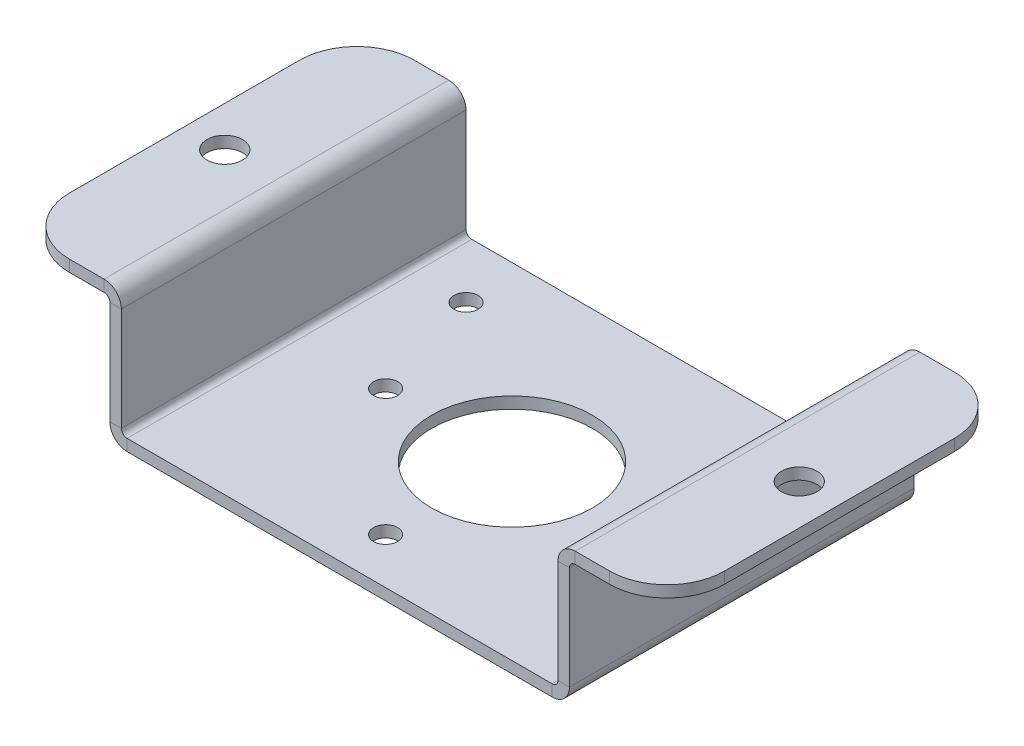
ISO-10303-21;
HEADER;
FILE_DESCRIPTION(('STEP AP214'),'2;1');
FILE_NAME('part.step','',(''),(''),'','','');
FILE_SCHEMA(('AUTOMOTIVE_DESIGN { 1 0 10303 214 1 1 1 1 }'));
ENDSEC;
DATA;
#1=APPLICATION_CONTEXT('core data for automotive mechanical design processes');
#2=APPLICATION_PROTOCOL_DEFINITION('international standard','automotive_design',2000,#1);
#3=PRODUCT_CONTEXT('',#1,'mechanical');
#4=PRODUCT('Part','Part','',(#3));
#5=PRODUCT_RELATED_PRODUCT_CATEGORY('part','',(#4));
#6=PRODUCT_DEFINITION_FORMATION('','',#4);
#7=PRODUCT_DEFINITION_CONTEXT('part definition',#1,'design');
#8=PRODUCT_DEFINITION('design','',#6,#7);
#9=PRODUCT_DEFINITION_SHAPE('','',#8);
#10=(LENGTH_UNIT() NAMED_UNIT(*) SI_UNIT(.MILLI.,.METRE.));
#11=(NAMED_UNIT(*) PLANE_ANGLE_UNIT() SI_UNIT($,.RADIAN.));
#12=(NAMED_UNIT(*) SI_UNIT($,.STERADIAN.) SOLID_ANGLE_UNIT());
#13=UNCERTAINTY_MEASURE_WITH_UNIT(LENGTH_MEASURE(1.E-05),#10,'distance_accuracy_value','');
#14=(GEOMETRIC_REPRESENTATION_CONTEXT(3) GLOBAL_UNCERTAINTY_ASSIGNED_CONTEXT((#13)) GLOBAL_UNIT_ASSIGNED_CONTEXT((#10,
#11,#12)) REPRESENTATION_CONTEXT('',''));
#15=CARTESIAN_POINT('',(0.,0.,0.));
#16=DIRECTION('',(0.,0.,1.));
#17=DIRECTION('',(1.,0.,0.));
#18=AXIS2_PLACEMENT_3D('',#15,#16,#17);
#19=CARTESIAN_POINT('',(-40.,0.,-30.));
#20=DIRECTION('',(0.,0.,-1.));
#21=DIRECTION('',(-1.,0.,0.));
#22=AXIS2_PLACEMENT_3D('',#19,#20,#21);
#23=PLANE('',#22);
#24=DIRECTION('',(0.,-1.,0.));
#25=VECTOR('',#24,1.);
#26=CARTESIAN_POINT('',(-40.,0.,-30.));
#27=LINE('',#26,#25);
#28=CARTESIAN_POINT('',(-40.,0.999999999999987,-30.));
#29=VERTEX_POINT('',#28);
#30=CARTESIAN_POINT('',(-40.0000000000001,19.,-30.));
#31=VERTEX_POINT('',#30);
#32=EDGE_CURVE('E394',#29,#31,#27,.F.);
#33=ORIENTED_EDGE('',*,*,#32,.T.);
#34=DIRECTION('',(1.,0.,0.));
#35=VECTOR('',#34,1.);
#36=CARTESIAN_POINT('',(-40.0000000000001,19.,-30.));
#37=LINE('',#36,#35);
#38=CARTESIAN_POINT('',(-38.0000000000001,19.,-30.));
#39=VERTEX_POINT('',#38);
#40=EDGE_CURVE('E333',#31,#39,#37,.T.);
#41=ORIENTED_EDGE('',*,*,#40,.T.);
#42=DIRECTION('',(0.,1.,0.));
#43=VECTOR('',#42,1.);
#44=CARTESIAN_POINT('',(-38.0000000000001,22.,-30.));
#45=LINE('',#44,#43);
#46=CARTESIAN_POINT('',(-38.,0.999999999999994,-30.));
#47=VERTEX_POINT('',#46);
#48=EDGE_CURVE('E399',#47,#39,#45,.T.);
#49=ORIENTED_EDGE('',*,*,#48,.F.);
#50=DIRECTION('',(-1.,0.,0.));
#51=VECTOR('',#50,1.);
#52=CARTESIAN_POINT('',(-40.,0.999999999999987,-30.));
#53=LINE('',#52,#51);
#54=EDGE_CURVE('E389',#47,#29,#53,.T.);
#55=ORIENTED_EDGE('',*,*,#54,.T.);
#56=EDGE_LOOP('',(#33,#41,#49,#55));
#57=FACE_BOUND('',#56,.T.);
#58=ADVANCED_FACE('F114',(#57),#23,.T.);
#59=CARTESIAN_POINT('',(-40.0000000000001,22.,-30.));
#60=DIRECTION('',(1.,0.,0.));
#61=DIRECTION('',(0.,1.,0.));
#62=AXIS2_PLACEMENT_3D('',#59,#60,#61);
#63=PLANE('',#62);
#64=DIRECTION('',(0.,0.,-1.));
#65=VECTOR('',#64,1.);
#66=CARTESIAN_POINT('',(-40.0000000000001,19.,-30.));
#67=LINE('',#66,#65);
#68=CARTESIAN_POINT('',(-40.0000000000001,19.,30.));
#69=VERTEX_POINT('',#68);
#70=EDGE_CURVE('E337',#31,#69,#67,.F.);
#71=ORIENTED_EDGE('',*,*,#70,.F.);
#72=ORIENTED_EDGE('',*,*,#32,.F.);
#73=DIRECTION('',(0.,0.,1.));
#74=VECTOR('',#73,1.);
#75=CARTESIAN_POINT('',(-40.,0.999999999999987,-30.));
#76=LINE('',#75,#74);
#77=CARTESIAN_POINT('',(-40.,0.999999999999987,30.));
#78=VERTEX_POINT('',#77);
#79=EDGE_CURVE('E402',#78,#29,#76,.F.);
#80=ORIENTED_EDGE('',*,*,#79,.F.);
#81=DIRECTION('',(0.,1.,0.));
#82=VECTOR('',#81,1.);
#83=CARTESIAN_POINT('',(-40.0000000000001,22.,30.));
#84=LINE('',#83,#82);
#85=EDGE_CURVE('E391',#69,#78,#84,.F.);
#86=ORIENTED_EDGE('',*,*,#85,.F.);
#87=EDGE_LOOP('',(#71,#72,#80,#86));
#88=FACE_BOUND('',#87,.T.);
#89=ADVANCED_FACE('F603',(#88),#63,.F.);
#90=CARTESIAN_POINT('',(-38.0000000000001,22.,-30.));
#91=DIRECTION('',(1.,0.,0.));
#92=DIRECTION('',(0.,1.,0.));
#93=AXIS2_PLACEMENT_3D('',#90,#91,#92);
#94=PLANE('',#93);
#95=ORIENTED_EDGE('',*,*,#48,.T.);
#96=DIRECTION('',(0.,0.,-1.));
#97=VECTOR('',#96,1.);
#98=CARTESIAN_POINT('',(-38.0000000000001,19.,-30.));
#99=LINE('',#98,#97);
#100=CARTESIAN_POINT('',(-38.0000000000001,19.,30.));
#101=VERTEX_POINT('',#100);
#102=EDGE_CURVE('E285',#39,#101,#99,.F.);
#103=ORIENTED_EDGE('',*,*,#102,.T.);
#104=DIRECTION('',(0.,-1.,0.));
#105=VECTOR('',#104,1.);
#106=CARTESIAN_POINT('',(-38.0000000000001,22.,30.));
#107=LINE('',#106,#105);
#108=CARTESIAN_POINT('',(-38.,0.999999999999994,30.));
#109=VERTEX_POINT('',#108);
#110=EDGE_CURVE('E397',#101,#109,#107,.T.);
#111=ORIENTED_EDGE('',*,*,#110,.T.);
#112=DIRECTION('',(0.,0.,1.));
#113=VECTOR('',#112,1.);
#114=CARTESIAN_POINT('',(-38.,0.999999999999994,-30.));
#115=LINE('',#114,#113);
#116=EDGE_CURVE('E407',#47,#109,#115,.T.);
#117=ORIENTED_EDGE('',*,*,#116,.F.);
#118=EDGE_LOOP('',(#95,#103,#111,#117));
#119=FACE_BOUND('',#118,.T.);
#120=ADVANCED_FACE('F611',(#119),#94,.T.);
#121=CARTESIAN_POINT('',(40.0000000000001,22.,30.));
#122=DIRECTION('',(0.,0.,1.));
#123=DIRECTION('',(0.,-1.,0.));
#124=AXIS2_PLACEMENT_3D('',#121,#122,#123);
#125=PLANE('',#124);
#126=DIRECTION('',(0.,1.,0.));
#127=VECTOR('',#126,1.);
#128=CARTESIAN_POINT('',(40.0000000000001,22.,30.));
#129=LINE('',#128,#127);
#130=CARTESIAN_POINT('',(40.,0.999999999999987,30.));
#131=VERTEX_POINT('',#130);
#132=CARTESIAN_POINT('',(40.0000000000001,19.,30.));
#133=VERTEX_POINT('',#132);
#134=EDGE_CURVE('E438',#131,#133,#129,.T.);
#135=ORIENTED_EDGE('',*,*,#134,.T.);
#136=DIRECTION('',(-1.,0.,0.));
#137=VECTOR('',#136,1.);
#138=CARTESIAN_POINT('',(40.0000000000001,19.,30.));
#139=LINE('',#138,#137);
#140=CARTESIAN_POINT('',(38.0000000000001,19.,30.));
#141=VERTEX_POINT('',#140);
#142=EDGE_CURVE('E375',#133,#141,#139,.T.);
#143=ORIENTED_EDGE('',*,*,#142,.T.);
#144=DIRECTION('',(0.,-1.,0.));
#145=VECTOR('',#144,1.);
#146=CARTESIAN_POINT('',(38.,0.,30.));
#147=LINE('',#146,#145);
#148=CARTESIAN_POINT('',(38.,0.999999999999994,30.));
#149=VERTEX_POINT('',#148);
#150=EDGE_CURVE('E443',#149,#141,#147,.F.);
#151=ORIENTED_EDGE('',*,*,#150,.F.);
#152=DIRECTION('',(1.,0.,0.));
#153=VECTOR('',#152,1.);
#154=CARTESIAN_POINT('',(40.,0.999999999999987,30.));
#155=LINE('',#154,#153);
#156=EDGE_CURVE('E432',#149,#131,#155,.T.);
#157=ORIENTED_EDGE('',*,*,#156,.T.);
#158=EDGE_LOOP('',(#135,#143,#151,#157));
#159=FACE_BOUND('',#158,.T.);
#160=ADVANCED_FACE('F557',(#159),#125,.T.);
#161=CARTESIAN_POINT('',(40.,0.,-30.));
#162=DIRECTION('',(1.,0.,0.));
#163=DIRECTION('',(0.,1.,0.));
#164=AXIS2_PLACEMENT_3D('',#161,#162,#163);
#165=PLANE('',#164);
#166=DIRECTION('',(0.,-1.,0.));
#167=VECTOR('',#166,1.);
#168=CARTESIAN_POINT('',(40.,0.,-30.));
#169=LINE('',#168,#167);
#170=CARTESIAN_POINT('',(40.0000000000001,19.,-30.));
#171=VERTEX_POINT('',#170);
#172=CARTESIAN_POINT('',(40.,0.999999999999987,-30.));
#173=VERTEX_POINT('',#172);
#174=EDGE_CURVE('E435',#171,#173,#169,.T.);
#175=ORIENTED_EDGE('',*,*,#174,.F.);
#176=DIRECTION('',(0.,0.,1.));
#177=VECTOR('',#176,1.);
#178=CARTESIAN_POINT('',(40.0000000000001,19.,30.));
#179=LINE('',#178,#177);
#180=EDGE_CURVE('E381',#133,#171,#179,.F.);
#181=ORIENTED_EDGE('',*,*,#180,.F.);
#182=ORIENTED_EDGE('',*,*,#134,.F.);
#183=DIRECTION('',(0.,0.,-1.));
#184=VECTOR('',#183,1.);
#185=CARTESIAN_POINT('',(40.,0.999999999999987,-30.));
#186=LINE('',#185,#184);
#187=EDGE_CURVE('E446',#131,#173,#186,.T.);
#188=ORIENTED_EDGE('',*,*,#187,.T.);
#189=EDGE_LOOP('',(#175,#181,#182,#188));
#190=FACE_BOUND('',#189,.T.);
#191=ADVANCED_FACE('F555',(#190),#165,.T.);
#192=CARTESIAN_POINT('',(38.,0.,-30.));
#193=DIRECTION('',(1.,0.,0.));
#194=DIRECTION('',(0.,1.,0.));
#195=AXIS2_PLACEMENT_3D('',#192,#193,#194);
#196=PLANE('',#195);
#197=DIRECTION('',(0.,0.,1.));
#198=VECTOR('',#197,1.);
#199=CARTESIAN_POINT('',(38.0000000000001,19.,30.));
#200=LINE('',#199,#198);
#201=CARTESIAN_POINT('',(38.0000000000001,19.,-30.));
#202=VERTEX_POINT('',#201);
#203=EDGE_CURVE('E369',#141,#202,#200,.F.);
#204=ORIENTED_EDGE('',*,*,#203,.T.);
#205=DIRECTION('',(0.,1.,0.));
#206=VECTOR('',#205,1.);
#207=CARTESIAN_POINT('',(38.,0.,-30.));
#208=LINE('',#207,#206);
#209=CARTESIAN_POINT('',(38.,0.999999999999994,-30.));
#210=VERTEX_POINT('',#209);
#211=EDGE_CURVE('E441',#202,#210,#208,.F.);
#212=ORIENTED_EDGE('',*,*,#211,.T.);
#213=DIRECTION('',(0.,0.,1.));
#214=VECTOR('',#213,1.);
#215=CARTESIAN_POINT('',(38.,0.999999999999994,30.));
#216=LINE('',#215,#214);
#217=EDGE_CURVE('E452',#149,#210,#216,.F.);
#218=ORIENTED_EDGE('',*,*,#217,.F.);
#219=ORIENTED_EDGE('',*,*,#150,.T.);
#220=EDGE_LOOP('',(#204,#212,#218,#219));
#221=FACE_BOUND('',#220,.T.);
#222=ADVANCED_FACE('F568',(#221),#196,.F.);
#223=CARTESIAN_POINT('',(-40.,-2.,30.));
#224=DIRECTION('',(0.,1.,0.));
#225=DIRECTION('',(0.,0.,1.));
#226=AXIS2_PLACEMENT_3D('',#223,#224,#225);
#227=PLANE('',#226);
#228=CARTESIAN_POINT('',(0.,-2.,0.));
#229=DIRECTION('',(0.,1.,0.));
#230=DIRECTION('',(0.,0.,1.));
#231=AXIS2_PLACEMENT_3D('',#228,#229,#230);
#232=CIRCLE('',#231,14.);
#233=CARTESIAN_POINT('',(0.,-2.,14.));
#234=VERTEX_POINT('',#233);
#235=EDGE_CURVE('E711',#234,#234,#232,.T.);
#236=ORIENTED_EDGE('',*,*,#235,.T.);
#237=EDGE_LOOP('',(#236));
#238=FACE_BOUND('',#237,.T.);
#239=CARTESIAN_POINT('',(0.,-2.,22.));
#240=DIRECTION('',(0.,1.,0.));
#241=DIRECTION('',(0.,0.,1.));
#242=AXIS2_PLACEMENT_3D('',#239,#240,#241);
#243=CIRCLE('',#242,2.1);
#244=CARTESIAN_POINT('',(0.,-2.,24.1));
#245=VERTEX_POINT('',#244);
#246=EDGE_CURVE('E706',#245,#245,#243,.T.);
#247=ORIENTED_EDGE('',*,*,#246,.T.);
#248=EDGE_LOOP('',(#247));
#249=FACE_BOUND('',#248,.T.);
#250=CARTESIAN_POINT('',(-22.,-2.,0.));
#251=DIRECTION('',(0.,1.,0.));
#252=DIRECTION('',(0.,0.,1.));
#253=AXIS2_PLACEMENT_3D('',#250,#251,#252);
#254=CIRCLE('',#253,2.1);
#255=CARTESIAN_POINT('',(-22.,-2.,2.1));
#256=VERTEX_POINT('',#255);
#257=EDGE_CURVE('E702',#256,#256,#254,.T.);
#258=ORIENTED_EDGE('',*,*,#257,.T.);
#259=EDGE_LOOP('',(#258));
#260=FACE_BOUND('',#259,.T.);
#261=CARTESIAN_POINT('',(22.,-2.,0.));
#262=DIRECTION('',(0.,1.,0.));
#263=DIRECTION('',(0.,0.,1.));
#264=AXIS2_PLACEMENT_3D('',#261,#262,#263);
#265=CIRCLE('',#264,2.1);
#266=CARTESIAN_POINT('',(22.,-2.,2.1));
#267=VERTEX_POINT('',#266);
#268=EDGE_CURVE('E698',#267,#267,#265,.T.);
#269=ORIENTED_EDGE('',*,*,#268,.T.);
#270=EDGE_LOOP('',(#269));
#271=FACE_BOUND('',#270,.T.);
#272=CARTESIAN_POINT('',(28.,-2.,-20.));
#273=DIRECTION('',(0.,1.,0.));
#274=DIRECTION('',(0.,0.,1.));
#275=AXIS2_PLACEMENT_3D('',#272,#273,#274);
#276=CIRCLE('',#275,2.1);
#277=CARTESIAN_POINT('',(28.,-2.,-17.9));
#278=VERTEX_POINT('',#277);
#279=EDGE_CURVE('E690',#278,#278,#276,.T.);
#280=ORIENTED_EDGE('',*,*,#279,.T.);
#281=EDGE_LOOP('',(#280));
#282=FACE_BOUND('',#281,.T.);
#283=CARTESIAN_POINT('',(-28.,-2.,-20.));
#284=DIRECTION('',(0.,1.,0.));
#285=DIRECTION('',(0.,0.,1.));
#286=AXIS2_PLACEMENT_3D('',#283,#284,#285);
#287=CIRCLE('',#286,2.1);
#288=CARTESIAN_POINT('',(-28.,-2.,-17.9));
#289=VERTEX_POINT('',#288);
#290=EDGE_CURVE('E330',#289,#289,#287,.T.);
#291=ORIENTED_EDGE('',*,*,#290,.T.);
#292=EDGE_LOOP('',(#291));
#293=FACE_BOUND('',#292,.T.);
#294=DIRECTION('',(0.,0.,1.));
#295=VECTOR('',#294,1.);
#296=CARTESIAN_POINT('',(-37.,-2.,30.));
#297=LINE('',#296,#295);
#298=CARTESIAN_POINT('',(-37.,-2.,30.));
#299=VERTEX_POINT('',#298);
#300=CARTESIAN_POINT('',(-37.,-2.,-30.));
#301=VERTEX_POINT('',#300);
#302=EDGE_CURVE('E412',#299,#301,#297,.F.);
#303=ORIENTED_EDGE('',*,*,#302,.T.);
#304=DIRECTION('',(-1.,0.,0.));
#305=VECTOR('',#304,1.);
#306=CARTESIAN_POINT('',(-40.,-2.,-30.));
#307=LINE('',#306,#305);
#308=CARTESIAN_POINT('',(37.,-2.,-30.));
#309=VERTEX_POINT('',#308);
#310=EDGE_CURVE('E483',#309,#301,#307,.T.);
#311=ORIENTED_EDGE('',*,*,#310,.F.);
#312=DIRECTION('',(0.,0.,-1.));
#313=VECTOR('',#312,1.);
#314=CARTESIAN_POINT('',(37.,-2.,-30.));
#315=LINE('',#314,#313);
#316=CARTESIAN_POINT('',(37.,-2.,30.));
#317=VERTEX_POINT('',#316);
#318=EDGE_CURVE('E457',#309,#317,#315,.F.);
#319=ORIENTED_EDGE('',*,*,#318,.T.);
#320=DIRECTION('',(1.,0.,0.));
#321=VECTOR('',#320,1.);
#322=CARTESIAN_POINT('',(-40.,-2.,30.));
#323=LINE('',#322,#321);
#324=EDGE_CURVE('E481',#299,#317,#323,.T.);
#325=ORIENTED_EDGE('',*,*,#324,.F.);
#326=EDGE_LOOP('',(#303,#311,#319,#325));
#327=FACE_BOUND('',#326,.T.);
#328=ADVANCED_FACE('F581',(#238,#249,#260,#271,#282,#293,#327),#227,.F.);
#329=CARTESIAN_POINT('',(-40.,0.,30.));
#330=DIRECTION('',(0.,1.,0.));
#331=DIRECTION('',(0.,0.,1.));
#332=AXIS2_PLACEMENT_3D('',#329,#330,#331);
#333=PLANE('',#332);
#334=CARTESIAN_POINT('',(0.,0.,0.));
#335=DIRECTION('',(0.,1.,0.));
#336=DIRECTION('',(0.,0.,1.));
#337=AXIS2_PLACEMENT_3D('',#334,#335,#336);
#338=CIRCLE('',#337,14.);
#339=CARTESIAN_POINT('',(0.,0.,14.));
#340=VERTEX_POINT('',#339);
#341=EDGE_CURVE('E669',#340,#340,#338,.T.);
#342=ORIENTED_EDGE('',*,*,#341,.F.);
#343=EDGE_LOOP('',(#342));
#344=FACE_BOUND('',#343,.T.);
#345=CARTESIAN_POINT('',(0.,0.,22.));
#346=DIRECTION('',(0.,1.,0.));
#347=DIRECTION('',(0.,0.,1.));
#348=AXIS2_PLACEMENT_3D('',#345,#346,#347);
#349=CIRCLE('',#348,2.1);
#350=CARTESIAN_POINT('',(0.,0.,24.1));
#351=VERTEX_POINT('',#350);
#352=EDGE_CURVE('E673',#351,#351,#349,.T.);
#353=ORIENTED_EDGE('',*,*,#352,.F.);
#354=EDGE_LOOP('',(#353));
#355=FACE_BOUND('',#354,.T.);
#356=CARTESIAN_POINT('',(-22.,0.,0.));
#357=DIRECTION('',(0.,1.,0.));
#358=DIRECTION('',(0.,0.,1.));
#359=AXIS2_PLACEMENT_3D('',#356,#357,#358);
#360=CIRCLE('',#359,2.1);
#361=CARTESIAN_POINT('',(-22.,0.,2.1));
#362=VERTEX_POINT('',#361);
#363=EDGE_CURVE('E677',#362,#362,#360,.T.);
#364=ORIENTED_EDGE('',*,*,#363,.F.);
#365=EDGE_LOOP('',(#364));
#366=FACE_BOUND('',#365,.T.);
#367=CARTESIAN_POINT('',(22.,0.,0.));
#368=DIRECTION('',(0.,1.,0.));
#369=DIRECTION('',(0.,0.,1.));
#370=AXIS2_PLACEMENT_3D('',#367,#368,#369);
#371=CIRCLE('',#370,2.1);
#372=CARTESIAN_POINT('',(22.,0.,2.1));
#373=VERTEX_POINT('',#372);
#374=EDGE_CURVE('E681',#373,#373,#371,.T.);
#375=ORIENTED_EDGE('',*,*,#374,.F.);
#376=EDGE_LOOP('',(#375));
#377=FACE_BOUND('',#376,.T.);
#378=CARTESIAN_POINT('',(28.,0.,-20.));
#379=DIRECTION('',(0.,1.,0.));
#380=DIRECTION('',(0.,0.,1.));
#381=AXIS2_PLACEMENT_3D('',#378,#379,#380);
#382=CIRCLE('',#381,2.1);
#383=CARTESIAN_POINT('',(28.,0.,-17.9));
#384=VERTEX_POINT('',#383);
#385=EDGE_CURVE('E685',#384,#384,#382,.T.);
#386=ORIENTED_EDGE('',*,*,#385,.F.);
#387=EDGE_LOOP('',(#386));
#388=FACE_BOUND('',#387,.T.);
#389=CARTESIAN_POINT('',(-28.,0.,-20.));
#390=DIRECTION('',(0.,1.,0.));
#391=DIRECTION('',(0.,0.,1.));
#392=AXIS2_PLACEMENT_3D('',#389,#390,#391);
#393=CIRCLE('',#392,2.1);
#394=CARTESIAN_POINT('',(-28.,0.,-17.9));
#395=VERTEX_POINT('',#394);
#396=EDGE_CURVE('E688',#395,#395,#393,.T.);
#397=ORIENTED_EDGE('',*,*,#396,.F.);
#398=EDGE_LOOP('',(#397));
#399=FACE_BOUND('',#398,.T.);
#400=DIRECTION('',(-1.,0.,0.));
#401=VECTOR('',#400,1.);
#402=CARTESIAN_POINT('',(-40.,0.,-30.));
#403=LINE('',#402,#401);
#404=CARTESIAN_POINT('',(37.,0.,-30.));
#405=VERTEX_POINT('',#404);
#406=CARTESIAN_POINT('',(-37.,0.,-30.));
#407=VERTEX_POINT('',#406);
#408=EDGE_CURVE('E484',#405,#407,#403,.T.);
#409=ORIENTED_EDGE('',*,*,#408,.T.);
#410=DIRECTION('',(0.,0.,1.));
#411=VECTOR('',#410,1.);
#412=CARTESIAN_POINT('',(-37.,0.,30.));
#413=LINE('',#412,#411);
#414=CARTESIAN_POINT('',(-37.,0.,30.));
#415=VERTEX_POINT('',#414);
#416=EDGE_CURVE('E424',#415,#407,#413,.F.);
#417=ORIENTED_EDGE('',*,*,#416,.F.);
#418=DIRECTION('',(1.,0.,0.));
#419=VECTOR('',#418,1.);
#420=CARTESIAN_POINT('',(-40.,0.,30.));
#421=LINE('',#420,#419);
#422=CARTESIAN_POINT('',(37.,0.,30.));
#423=VERTEX_POINT('',#422);
#424=EDGE_CURVE('E478',#415,#423,#421,.T.);
#425=ORIENTED_EDGE('',*,*,#424,.T.);
#426=DIRECTION('',(0.,0.,-1.));
#427=VECTOR('',#426,1.);
#428=CARTESIAN_POINT('',(37.,0.,-30.));
#429=LINE('',#428,#427);
#430=EDGE_CURVE('E470',#405,#423,#429,.F.);
#431=ORIENTED_EDGE('',*,*,#430,.F.);
#432=EDGE_LOOP('',(#409,#417,#425,#431));
#433=FACE_BOUND('',#432,.T.);
#434=ADVANCED_FACE('F615',(#344,#355,#366,#377,#388,#399,#433),#333,.T.);
#435=CARTESIAN_POINT('',(-40.,-2.,30.));
#436=DIRECTION('',(0.,0.,1.));
#437=DIRECTION('',(1.,0.,0.));
#438=AXIS2_PLACEMENT_3D('',#435,#436,#437);
#439=PLANE('',#438);
#440=ORIENTED_EDGE('',*,*,#424,.F.);
#441=DIRECTION('',(0.,-1.,0.));
#442=VECTOR('',#441,1.);
#443=CARTESIAN_POINT('',(-37.,0.,30.));
#444=LINE('',#443,#442);
#445=EDGE_CURVE('E418',#415,#299,#444,.T.);
#446=ORIENTED_EDGE('',*,*,#445,.T.);
#447=ORIENTED_EDGE('',*,*,#324,.T.);
#448=DIRECTION('',(0.,-1.,0.));
#449=VECTOR('',#448,1.);
#450=CARTESIAN_POINT('',(37.,0.,30.));
#451=LINE('',#450,#449);
#452=EDGE_CURVE('E475',#423,#317,#451,.T.);
#453=ORIENTED_EDGE('',*,*,#452,.F.);
#454=EDGE_LOOP('',(#440,#446,#447,#453));
#455=FACE_BOUND('',#454,.T.);
#456=ADVANCED_FACE('F585',(#455),#439,.T.);
#457=CARTESIAN_POINT('',(-40.,-2.,-30.));
#458=DIRECTION('',(0.,0.,-1.));
#459=DIRECTION('',(-1.,0.,0.));
#460=AXIS2_PLACEMENT_3D('',#457,#458,#459);
#461=PLANE('',#460);
#462=DIRECTION('',(0.,-1.,0.));
#463=VECTOR('',#462,1.);
#464=CARTESIAN_POINT('',(-37.,0.,-30.));
#465=LINE('',#464,#463);
#466=EDGE_CURVE('E429',#407,#301,#465,.T.);
#467=ORIENTED_EDGE('',*,*,#466,.F.);
#468=ORIENTED_EDGE('',*,*,#408,.F.);
#469=DIRECTION('',(0.,-1.,0.));
#470=VECTOR('',#469,1.);
#471=CARTESIAN_POINT('',(37.,0.,-30.));
#472=LINE('',#471,#470);
#473=EDGE_CURVE('E464',#405,#309,#472,.T.);
#474=ORIENTED_EDGE('',*,*,#473,.T.);
#475=ORIENTED_EDGE('',*,*,#310,.T.);
#476=EDGE_LOOP('',(#467,#468,#474,#475));
#477=FACE_BOUND('',#476,.T.);
#478=ADVANCED_FACE('F618',(#477),#461,.T.);
#479=CARTESIAN_POINT('',(37.,0.999999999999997,30.));
#480=DIRECTION('',(0.,0.,1.));
#481=DIRECTION('',(1.,0.,0.));
#482=AXIS2_PLACEMENT_3D('',#479,#480,#481);
#483=PLANE('',#482);
#484=ORIENTED_EDGE('',*,*,#156,.F.);
#485=CARTESIAN_POINT('',(37.,0.999999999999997,30.));
#486=DIRECTION('',(0.,0.,-1.));
#487=DIRECTION('',(-1.,0.,0.));
#488=AXIS2_PLACEMENT_3D('',#485,#486,#487);
#489=CIRCLE('',#488,1.);
#490=EDGE_CURVE('E467',#423,#149,#489,.F.);
#491=ORIENTED_EDGE('',*,*,#490,.F.);
#492=ORIENTED_EDGE('',*,*,#452,.T.);
#493=CARTESIAN_POINT('',(37.,0.999999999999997,30.));
#494=DIRECTION('',(0.,0.,-1.));
#495=DIRECTION('',(-1.,0.,0.));
#496=AXIS2_PLACEMENT_3D('',#493,#494,#495);
#497=CIRCLE('',#496,3.);
#498=EDGE_CURVE('E460',#317,#131,#497,.F.);
#499=ORIENTED_EDGE('',*,*,#498,.T.);
#500=EDGE_LOOP('',(#484,#491,#492,#499));
#501=FACE_BOUND('',#500,.T.);
#502=ADVANCED_FACE('F561',(#501),#483,.T.);
#503=CARTESIAN_POINT('',(37.,0.999999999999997,-30.));
#504=DIRECTION('',(0.,0.,1.));
#505=DIRECTION('',(1.,0.,0.));
#506=AXIS2_PLACEMENT_3D('',#503,#504,#505);
#507=PLANE('',#506);
#508=CARTESIAN_POINT('',(37.,0.999999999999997,-30.));
#509=DIRECTION('',(0.,0.,-1.));
#510=DIRECTION('',(-1.,0.,0.));
#511=AXIS2_PLACEMENT_3D('',#508,#509,#510);
#512=CIRCLE('',#511,1.);
#513=EDGE_CURVE('E437',#210,#405,#512,.T.);
#514=ORIENTED_EDGE('',*,*,#513,.F.);
#515=DIRECTION('',(1.,0.,0.));
#516=VECTOR('',#515,1.);
#517=CARTESIAN_POINT('',(38.,0.999999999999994,-30.));
#518=LINE('',#517,#516);
#519=EDGE_CURVE('E449',#210,#173,#518,.T.);
#520=ORIENTED_EDGE('',*,*,#519,.T.);
#521=CARTESIAN_POINT('',(37.,0.999999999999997,-30.));
#522=DIRECTION('',(0.,0.,-1.));
#523=DIRECTION('',(-1.,0.,0.));
#524=AXIS2_PLACEMENT_3D('',#521,#522,#523);
#525=CIRCLE('',#524,3.);
#526=EDGE_CURVE('E461',#173,#309,#525,.T.);
#527=ORIENTED_EDGE('',*,*,#526,.T.);
#528=ORIENTED_EDGE('',*,*,#473,.F.);
#529=EDGE_LOOP('',(#514,#520,#527,#528));
#530=FACE_BOUND('',#529,.T.);
#531=ADVANCED_FACE('F575',(#530),#507,.F.);
#532=CARTESIAN_POINT('',(37.,0.999999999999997,-30.));
#533=DIRECTION('',(0.,0.,-1.));
#534=DIRECTION('',(1.,0.,0.));
#535=AXIS2_PLACEMENT_3D('',#532,#533,#534);
#536=CYLINDRICAL_SURFACE('',#535,3.);
#537=ORIENTED_EDGE('',*,*,#318,.F.);
#538=ORIENTED_EDGE('',*,*,#526,.F.);
#539=ORIENTED_EDGE('',*,*,#187,.F.);
#540=ORIENTED_EDGE('',*,*,#498,.F.);
#541=EDGE_LOOP('',(#537,#538,#539,#540));
#542=FACE_BOUND('',#541,.T.);
#543=ADVANCED_FACE('F579',(#542),#536,.T.);
#544=CARTESIAN_POINT('',(37.,0.999999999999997,-30.));
#545=DIRECTION('',(0.,0.,-1.));
#546=DIRECTION('',(1.,0.,0.));
#547=AXIS2_PLACEMENT_3D('',#544,#545,#546);
#548=CYLINDRICAL_SURFACE('',#547,1.);
#549=ORIENTED_EDGE('',*,*,#430,.T.);
#550=ORIENTED_EDGE('',*,*,#490,.T.);
#551=ORIENTED_EDGE('',*,*,#217,.T.);
#552=ORIENTED_EDGE('',*,*,#513,.T.);
#553=EDGE_LOOP('',(#549,#550,#551,#552));
#554=FACE_BOUND('',#553,.T.);
#555=ADVANCED_FACE('F565',(#554),#548,.F.);
#556=CARTESIAN_POINT('',(40.,0.,-30.));
#557=DIRECTION('',(0.,0.,-1.));
#558=DIRECTION('',(0.,1.,0.));
#559=AXIS2_PLACEMENT_3D('',#556,#557,#558);
#560=PLANE('',#559);
#561=DIRECTION('',(-1.,0.,0.));
#562=VECTOR('',#561,1.);
#563=CARTESIAN_POINT('',(40.0000000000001,19.,-30.));
#564=LINE('',#563,#562);
#565=EDGE_CURVE('E386',#171,#202,#564,.T.);
#566=ORIENTED_EDGE('',*,*,#565,.F.);
#567=ORIENTED_EDGE('',*,*,#174,.T.);
#568=ORIENTED_EDGE('',*,*,#519,.F.);
#569=ORIENTED_EDGE('',*,*,#211,.F.);
#570=EDGE_LOOP('',(#566,#567,#568,#569));
#571=FACE_BOUND('',#570,.T.);
#572=ADVANCED_FACE('F572',(#571),#560,.T.);
#573=CARTESIAN_POINT('',(-37.,0.999999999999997,-30.));
#574=DIRECTION('',(0.,0.,-1.));
#575=DIRECTION('',(-1.,0.,0.));
#576=AXIS2_PLACEMENT_3D('',#573,#574,#575);
#577=PLANE('',#576);
#578=ORIENTED_EDGE('',*,*,#54,.F.);
#579=CARTESIAN_POINT('',(-37.,0.999999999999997,-30.));
#580=DIRECTION('',(0.,0.,1.));
#581=DIRECTION('',(1.,0.,0.));
#582=AXIS2_PLACEMENT_3D('',#579,#580,#581);
#583=CIRCLE('',#582,1.);
#584=EDGE_CURVE('E421',#407,#47,#583,.F.);
#585=ORIENTED_EDGE('',*,*,#584,.F.);
#586=ORIENTED_EDGE('',*,*,#466,.T.);
#587=CARTESIAN_POINT('',(-37.,0.999999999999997,-30.));
#588=DIRECTION('',(0.,0.,1.));
#589=DIRECTION('',(1.,0.,0.));
#590=AXIS2_PLACEMENT_3D('',#587,#588,#589);
#591=CIRCLE('',#590,3.);
#592=EDGE_CURVE('E414',#301,#29,#591,.F.);
#593=ORIENTED_EDGE('',*,*,#592,.T.);
#594=EDGE_LOOP('',(#578,#585,#586,#593));
#595=FACE_BOUND('',#594,.T.);
#596=ADVANCED_FACE('F605',(#595),#577,.T.);
#597=CARTESIAN_POINT('',(-37.,0.999999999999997,30.));
#598=DIRECTION('',(0.,0.,-1.));
#599=DIRECTION('',(-1.,0.,0.));
#600=AXIS2_PLACEMENT_3D('',#597,#598,#599);
#601=PLANE('',#600);
#602=CARTESIAN_POINT('',(-37.,0.999999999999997,30.));
#603=DIRECTION('',(0.,0.,1.));
#604=DIRECTION('',(1.,0.,0.));
#605=AXIS2_PLACEMENT_3D('',#602,#603,#604);
#606=CIRCLE('',#605,1.);
#607=EDGE_CURVE('E393',#109,#415,#606,.T.);
#608=ORIENTED_EDGE('',*,*,#607,.F.);
#609=DIRECTION('',(-1.,0.,0.));
#610=VECTOR('',#609,1.);
#611=CARTESIAN_POINT('',(-38.,0.999999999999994,30.));
#612=LINE('',#611,#610);
#613=EDGE_CURVE('E404',#109,#78,#612,.T.);
#614=ORIENTED_EDGE('',*,*,#613,.T.);
#615=CARTESIAN_POINT('',(-37.,0.999999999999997,30.));
#616=DIRECTION('',(0.,0.,1.));
#617=DIRECTION('',(1.,0.,0.));
#618=AXIS2_PLACEMENT_3D('',#615,#616,#617);
#619=CIRCLE('',#618,3.);
#620=EDGE_CURVE('E415',#78,#299,#619,.T.);
#621=ORIENTED_EDGE('',*,*,#620,.T.);
#622=ORIENTED_EDGE('',*,*,#445,.F.);
#623=EDGE_LOOP('',(#608,#614,#621,#622));
#624=FACE_BOUND('',#623,.T.);
#625=ADVANCED_FACE('F594',(#624),#601,.F.);
#626=CARTESIAN_POINT('',(-37.,0.999999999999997,30.));
#627=DIRECTION('',(0.,0.,1.));
#628=DIRECTION('',(-1.,0.,0.));
#629=AXIS2_PLACEMENT_3D('',#626,#627,#628);
#630=CYLINDRICAL_SURFACE('',#629,3.);
#631=ORIENTED_EDGE('',*,*,#302,.F.);
#632=ORIENTED_EDGE('',*,*,#620,.F.);
#633=ORIENTED_EDGE('',*,*,#79,.T.);
#634=ORIENTED_EDGE('',*,*,#592,.F.);
#635=EDGE_LOOP('',(#631,#632,#633,#634));
#636=FACE_BOUND('',#635,.T.);
#637=ADVANCED_FACE('F593',(#636),#630,.T.);
#638=CARTESIAN_POINT('',(-37.,0.999999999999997,30.));
#639=DIRECTION('',(0.,0.,1.));
#640=DIRECTION('',(-1.,0.,0.));
#641=AXIS2_PLACEMENT_3D('',#638,#639,#640);
#642=CYLINDRICAL_SURFACE('',#641,1.);
#643=ORIENTED_EDGE('',*,*,#416,.T.);
#644=ORIENTED_EDGE('',*,*,#584,.T.);
#645=ORIENTED_EDGE('',*,*,#116,.T.);
#646=ORIENTED_EDGE('',*,*,#607,.T.);
#647=EDGE_LOOP('',(#643,#644,#645,#646));
#648=FACE_BOUND('',#647,.T.);
#649=ADVANCED_FACE('F613',(#648),#642,.F.);
#650=CARTESIAN_POINT('',(-40.0000000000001,22.,30.));
#651=DIRECTION('',(0.,0.,1.));
#652=DIRECTION('',(1.,0.,0.));
#653=AXIS2_PLACEMENT_3D('',#650,#651,#652);
#654=PLANE('',#653);
#655=DIRECTION('',(1.,0.,0.));
#656=VECTOR('',#655,1.);
#657=CARTESIAN_POINT('',(-40.0000000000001,19.,30.));
#658=LINE('',#657,#656);
#659=EDGE_CURVE('E340',#69,#101,#658,.T.);
#660=ORIENTED_EDGE('',*,*,#659,.F.);
#661=ORIENTED_EDGE('',*,*,#85,.T.);
#662=ORIENTED_EDGE('',*,*,#613,.F.);
#663=ORIENTED_EDGE('',*,*,#110,.F.);
#664=EDGE_LOOP('',(#660,#661,#662,#663));
#665=FACE_BOUND('',#664,.T.);
#666=ADVANCED_FACE('F636',(#665),#654,.T.);
#667=CARTESIAN_POINT('',(41.0000000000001,19.,-30.));
#668=DIRECTION('',(0.,0.,-1.));
#669=DIRECTION('',(-1.,0.,0.));
#670=AXIS2_PLACEMENT_3D('',#667,#668,#669);
#671=PLANE('',#670);
#672=DIRECTION('',(0.,-1.,0.));
#673=VECTOR('',#672,1.);
#674=CARTESIAN_POINT('',(41.0000000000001,22.,-30.));
#675=LINE('',#674,#673);
#676=CARTESIAN_POINT('',(41.0000000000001,20.,-30.));
#677=VERTEX_POINT('',#676);
#678=CARTESIAN_POINT('',(41.0000000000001,22.,-30.));
#679=VERTEX_POINT('',#678);
#680=EDGE_CURVE('E343',#677,#679,#675,.F.);
#681=ORIENTED_EDGE('',*,*,#680,.F.);
#682=CARTESIAN_POINT('',(41.0000000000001,19.,-30.));
#683=DIRECTION('',(0.,0.,1.));
#684=DIRECTION('',(1.,0.,0.));
#685=AXIS2_PLACEMENT_3D('',#682,#683,#684);
#686=CIRCLE('',#685,1.);
#687=EDGE_CURVE('E378',#171,#677,#686,.F.);
#688=ORIENTED_EDGE('',*,*,#687,.F.);
#689=ORIENTED_EDGE('',*,*,#565,.T.);
#690=CARTESIAN_POINT('',(41.0000000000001,19.,-30.));
#691=DIRECTION('',(0.,0.,1.));
#692=DIRECTION('',(1.,0.,0.));
#693=AXIS2_PLACEMENT_3D('',#690,#691,#692);
#694=CIRCLE('',#693,3.);
#695=EDGE_CURVE('E371',#202,#679,#694,.F.);
#696=ORIENTED_EDGE('',*,*,#695,.T.);
#697=EDGE_LOOP('',(#681,#688,#689,#696));
#698=FACE_BOUND('',#697,.T.);
#699=ADVANCED_FACE('F544',(#698),#671,.T.);
#700=CARTESIAN_POINT('',(41.0000000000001,19.,30.));
#701=DIRECTION('',(0.,0.,-1.));
#702=DIRECTION('',(-1.,0.,0.));
#703=AXIS2_PLACEMENT_3D('',#700,#701,#702);
#704=PLANE('',#703);
#705=CARTESIAN_POINT('',(41.0000000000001,19.,30.));
#706=DIRECTION('',(0.,0.,1.));
#707=DIRECTION('',(1.,0.,0.));
#708=AXIS2_PLACEMENT_3D('',#705,#706,#707);
#709=CIRCLE('',#708,1.);
#710=CARTESIAN_POINT('',(41.0000000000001,20.,30.));
#711=VERTEX_POINT('',#710);
#712=EDGE_CURVE('E347',#711,#133,#709,.T.);
#713=ORIENTED_EDGE('',*,*,#712,.F.);
#714=DIRECTION('',(0.,-1.,0.));
#715=VECTOR('',#714,1.);
#716=CARTESIAN_POINT('',(41.0000000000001,20.,30.));
#717=LINE('',#716,#715);
#718=CARTESIAN_POINT('',(41.0000000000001,22.,30.));
#719=VERTEX_POINT('',#718);
#720=EDGE_CURVE('E362',#711,#719,#717,.F.);
#721=ORIENTED_EDGE('',*,*,#720,.T.);
#722=CARTESIAN_POINT('',(41.0000000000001,19.,30.));
#723=DIRECTION('',(0.,0.,1.));
#724=DIRECTION('',(1.,0.,0.));
#725=AXIS2_PLACEMENT_3D('',#722,#723,#724);
#726=CIRCLE('',#725,3.);
#727=EDGE_CURVE('E372',#719,#141,#726,.T.);
#728=ORIENTED_EDGE('',*,*,#727,.T.);
#729=ORIENTED_EDGE('',*,*,#142,.F.);
#730=EDGE_LOOP('',(#713,#721,#728,#729));
#731=FACE_BOUND('',#730,.T.);
#732=ADVANCED_FACE('F536',(#731),#704,.F.);
#733=CARTESIAN_POINT('',(41.0000000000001,19.,30.));
#734=DIRECTION('',(0.,0.,1.));
#735=DIRECTION('',(0.,1.,0.));
#736=AXIS2_PLACEMENT_3D('',#733,#734,#735);
#737=CYLINDRICAL_SURFACE('',#736,3.);
#738=ORIENTED_EDGE('',*,*,#203,.F.);
#739=ORIENTED_EDGE('',*,*,#727,.F.);
#740=DIRECTION('',(0.,0.,1.));
#741=VECTOR('',#740,1.);
#742=CARTESIAN_POINT('',(41.0000000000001,22.,-30.));
#743=LINE('',#742,#741);
#744=EDGE_CURVE('E359',#719,#679,#743,.F.);
#745=ORIENTED_EDGE('',*,*,#744,.T.);
#746=ORIENTED_EDGE('',*,*,#695,.F.);
#747=EDGE_LOOP('',(#738,#739,#745,#746));
#748=FACE_BOUND('',#747,.T.);
#749=ADVANCED_FACE('F541',(#748),#737,.T.);
#750=CARTESIAN_POINT('',(41.0000000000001,19.,30.));
#751=DIRECTION('',(0.,0.,1.));
#752=DIRECTION('',(0.,1.,0.));
#753=AXIS2_PLACEMENT_3D('',#750,#751,#752);
#754=CYLINDRICAL_SURFACE('',#753,1.);
#755=ORIENTED_EDGE('',*,*,#180,.T.);
#756=ORIENTED_EDGE('',*,*,#687,.T.);
#757=DIRECTION('',(0.,0.,1.));
#758=VECTOR('',#757,1.);
#759=CARTESIAN_POINT('',(41.0000000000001,20.,-30.));
#760=LINE('',#759,#758);
#761=EDGE_CURVE('E365',#677,#711,#760,.T.);
#762=ORIENTED_EDGE('',*,*,#761,.T.);
#763=ORIENTED_EDGE('',*,*,#712,.T.);
#764=EDGE_LOOP('',(#755,#756,#762,#763));
#765=FACE_BOUND('',#764,.T.);
#766=ADVANCED_FACE('F551',(#765),#754,.F.);
#767=CARTESIAN_POINT('',(57.0000000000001,22.,30.));
#768=DIRECTION('',(0.,0.,-1.));
#769=DIRECTION('',(-1.,0.,0.));
#770=AXIS2_PLACEMENT_3D('',#767,#768,#769);
#771=PLANE('',#770);
#772=DIRECTION('',(-1.,0.,0.));
#773=VECTOR('',#772,1.);
#774=CARTESIAN_POINT('',(57.0000000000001,20.,30.));
#775=LINE('',#774,#773);
#776=CARTESIAN_POINT('',(47.0000000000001,20.,30.));
#777=VERTEX_POINT('',#776);
#778=EDGE_CURVE('E357',#711,#777,#775,.F.);
#779=ORIENTED_EDGE('',*,*,#778,.T.);
#780=DIRECTION('',(0.,-1.,0.));
#781=VECTOR('',#780,1.);
#782=CARTESIAN_POINT('',(47.0000000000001,22.,30.));
#783=LINE('',#782,#781);
#784=CARTESIAN_POINT('',(47.0000000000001,22.,30.));
#785=VERTEX_POINT('',#784);
#786=EDGE_CURVE('E137',#777,#785,#783,.F.);
#787=ORIENTED_EDGE('',*,*,#786,.T.);
#788=DIRECTION('',(1.,0.,0.));
#789=VECTOR('',#788,1.);
#790=CARTESIAN_POINT('',(40.0000000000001,22.,30.));
#791=LINE('',#790,#789);
#792=EDGE_CURVE('E350',#719,#785,#791,.T.);
#793=ORIENTED_EDGE('',*,*,#792,.F.);
#794=ORIENTED_EDGE('',*,*,#720,.F.);
#795=EDGE_LOOP('',(#779,#787,#793,#794));
#796=FACE_BOUND('',#795,.T.);
#797=ADVANCED_FACE('F533',(#796),#771,.F.);
#798=CARTESIAN_POINT('',(40.0000000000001,22.,-30.));
#799=DIRECTION('',(0.,0.,1.));
#800=DIRECTION('',(1.,0.,0.));
#801=AXIS2_PLACEMENT_3D('',#798,#799,#800);
#802=PLANE('',#801);
#803=DIRECTION('',(-1.,0.,0.));
#804=VECTOR('',#803,1.);
#805=CARTESIAN_POINT('',(40.0000000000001,22.,-30.));
#806=LINE('',#805,#804);
#807=CARTESIAN_POINT('',(47.0000000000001,22.,-30.));
#808=VERTEX_POINT('',#807);
#809=EDGE_CURVE('E345',#808,#679,#806,.T.);
#810=ORIENTED_EDGE('',*,*,#809,.F.);
#811=DIRECTION('',(0.,-1.,0.));
#812=VECTOR('',#811,1.);
#813=CARTESIAN_POINT('',(47.0000000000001,22.,-30.));
#814=LINE('',#813,#812);
#815=CARTESIAN_POINT('',(47.0000000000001,20.,-30.));
#816=VERTEX_POINT('',#815);
#817=EDGE_CURVE('E13',#808,#816,#814,.T.);
#818=ORIENTED_EDGE('',*,*,#817,.T.);
#819=DIRECTION('',(1.,0.,0.));
#820=VECTOR('',#819,1.);
#821=CARTESIAN_POINT('',(40.0000000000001,20.,-30.));
#822=LINE('',#821,#820);
#823=EDGE_CURVE('E352',#816,#677,#822,.F.);
#824=ORIENTED_EDGE('',*,*,#823,.T.);
#825=ORIENTED_EDGE('',*,*,#680,.T.);
#826=EDGE_LOOP('',(#810,#818,#824,#825));
#827=FACE_BOUND('',#826,.T.);
#828=ADVANCED_FACE('F547',(#827),#802,.F.);
#829=CARTESIAN_POINT('',(40.0000000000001,22.,30.));
#830=DIRECTION('',(0.,-1.,0.));
#831=DIRECTION('',(0.,0.,-1.));
#832=AXIS2_PLACEMENT_3D('',#829,#830,#831);
#833=PLANE('',#832);
#834=CARTESIAN_POINT('',(50.,22.,0.));
#835=DIRECTION('',(0.,-1.,0.));
#836=DIRECTION('',(0.,0.,-1.));
#837=AXIS2_PLACEMENT_3D('',#834,#835,#836);
#838=CIRCLE('',#837,3.1);
#839=CARTESIAN_POINT('',(50.,22.,-3.1));
#840=VERTEX_POINT('',#839);
#841=EDGE_CURVE('E714',#840,#840,#838,.T.);
#842=ORIENTED_EDGE('',*,*,#841,.T.);
#843=EDGE_LOOP('',(#842));
#844=FACE_BOUND('',#843,.T.);
#845=ORIENTED_EDGE('',*,*,#792,.T.);
#846=CARTESIAN_POINT('',(47.0000000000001,22.,20.));
#847=DIRECTION('',(0.,-1.,0.));
#848=DIRECTION('',(0.,0.,-1.));
#849=AXIS2_PLACEMENT_3D('',#846,#847,#848);
#850=CIRCLE('',#849,10.);
#851=CARTESIAN_POINT('',(57.0000000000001,22.,20.));
#852=VERTEX_POINT('',#851);
#853=EDGE_CURVE('E122',#785,#852,#850,.F.);
#854=ORIENTED_EDGE('',*,*,#853,.T.);
#855=DIRECTION('',(0.,0.,-1.));
#856=VECTOR('',#855,1.);
#857=CARTESIAN_POINT('',(57.0000000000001,22.,30.));
#858=LINE('',#857,#856);
#859=CARTESIAN_POINT('',(57.0000000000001,22.,-20.));
#860=VERTEX_POINT('',#859);
#861=EDGE_CURVE('E348',#852,#860,#858,.T.);
#862=ORIENTED_EDGE('',*,*,#861,.T.);
#863=CARTESIAN_POINT('',(47.0000000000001,22.,-20.));
#864=DIRECTION('',(0.,-1.,0.));
#865=DIRECTION('',(0.,0.,-1.));
#866=AXIS2_PLACEMENT_3D('',#863,#864,#865);
#867=CIRCLE('',#866,10.);
#868=EDGE_CURVE('E129',#860,#808,#867,.F.);
#869=ORIENTED_EDGE('',*,*,#868,.T.);
#870=ORIENTED_EDGE('',*,*,#809,.T.);
#871=ORIENTED_EDGE('',*,*,#744,.F.);
#872=EDGE_LOOP('',(#845,#854,#862,#869,#870,#871));
#873=FACE_BOUND('',#872,.T.);
#874=ADVANCED_FACE('F519',(#844,#873),#833,.F.);
#875=CARTESIAN_POINT('',(40.0000000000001,20.,30.));
#876=DIRECTION('',(0.,-1.,0.));
#877=DIRECTION('',(0.,0.,-1.));
#878=AXIS2_PLACEMENT_3D('',#875,#876,#877);
#879=PLANE('',#878);
#880=CARTESIAN_POINT('',(50.,20.,0.));
#881=DIRECTION('',(0.,-1.,0.));
#882=DIRECTION('',(0.,0.,-1.));
#883=AXIS2_PLACEMENT_3D('',#880,#881,#882);
#884=CIRCLE('',#883,3.1);
#885=CARTESIAN_POINT('',(50.,20.,-3.1));
#886=VERTEX_POINT('',#885);
#887=EDGE_CURVE('E717',#886,#886,#884,.T.);
#888=ORIENTED_EDGE('',*,*,#887,.F.);
#889=EDGE_LOOP('',(#888));
#890=FACE_BOUND('',#889,.T.);
#891=DIRECTION('',(0.,0.,1.));
#892=VECTOR('',#891,1.);
#893=CARTESIAN_POINT('',(57.0000000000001,20.,-30.));
#894=LINE('',#893,#892);
#895=CARTESIAN_POINT('',(57.0000000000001,20.,20.));
#896=VERTEX_POINT('',#895);
#897=CARTESIAN_POINT('',(57.0000000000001,20.,-20.));
#898=VERTEX_POINT('',#897);
#899=EDGE_CURVE('E354',#896,#898,#894,.F.);
#900=ORIENTED_EDGE('',*,*,#899,.F.);
#901=CARTESIAN_POINT('',(47.0000000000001,20.,20.));
#902=DIRECTION('',(0.,-1.,0.));
#903=DIRECTION('',(0.,0.,-1.));
#904=AXIS2_PLACEMENT_3D('',#901,#902,#903);
#905=CIRCLE('',#904,10.);
#906=EDGE_CURVE('E514',#896,#777,#905,.T.);
#907=ORIENTED_EDGE('',*,*,#906,.T.);
#908=ORIENTED_EDGE('',*,*,#778,.F.);
#909=ORIENTED_EDGE('',*,*,#761,.F.);
#910=ORIENTED_EDGE('',*,*,#823,.F.);
#911=CARTESIAN_POINT('',(47.0000000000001,20.,-20.));
#912=DIRECTION('',(0.,-1.,0.));
#913=DIRECTION('',(0.,0.,-1.));
#914=AXIS2_PLACEMENT_3D('',#911,#912,#913);
#915=CIRCLE('',#914,10.);
#916=EDGE_CURVE('E512',#816,#898,#915,.T.);
#917=ORIENTED_EDGE('',*,*,#916,.T.);
#918=EDGE_LOOP('',(#900,#907,#908,#909,#910,#917));
#919=FACE_BOUND('',#918,.T.);
#920=ADVANCED_FACE('F530',(#890,#919),#879,.T.);
#921=CARTESIAN_POINT('',(57.0000000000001,22.,-30.));
#922=DIRECTION('',(-1.,0.,0.));
#923=DIRECTION('',(0.,-1.,0.));
#924=AXIS2_PLACEMENT_3D('',#921,#922,#923);
#925=PLANE('',#924);
#926=ORIENTED_EDGE('',*,*,#861,.F.);
#927=DIRECTION('',(0.,-1.,0.));
#928=VECTOR('',#927,1.);
#929=CARTESIAN_POINT('',(57.0000000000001,22.,20.));
#930=LINE('',#929,#928);
#931=EDGE_CURVE('E509',#852,#896,#930,.T.);
#932=ORIENTED_EDGE('',*,*,#931,.T.);
#933=ORIENTED_EDGE('',*,*,#899,.T.);
#934=DIRECTION('',(0.,-1.,0.));
#935=VECTOR('',#934,1.);
#936=CARTESIAN_POINT('',(57.0000000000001,22.,-20.));
#937=LINE('',#936,#935);
#938=EDGE_CURVE('E507',#898,#860,#937,.F.);
#939=ORIENTED_EDGE('',*,*,#938,.T.);
#940=EDGE_LOOP('',(#926,#932,#933,#939));
#941=FACE_BOUND('',#940,.T.);
#942=ADVANCED_FACE('F524',(#941),#925,.F.);
#943=CARTESIAN_POINT('',(-41.0000000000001,19.,30.));
#944=DIRECTION('',(0.,0.,1.));
#945=DIRECTION('',(1.,0.,0.));
#946=AXIS2_PLACEMENT_3D('',#943,#944,#945);
#947=PLANE('',#946);
#948=DIRECTION('',(0.,-1.,0.));
#949=VECTOR('',#948,1.);
#950=CARTESIAN_POINT('',(-41.0000000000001,22.,30.));
#951=LINE('',#950,#949);
#952=CARTESIAN_POINT('',(-41.0000000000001,20.,30.));
#953=VERTEX_POINT('',#952);
#954=CARTESIAN_POINT('',(-41.0000000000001,22.,30.));
#955=VERTEX_POINT('',#954);
#956=EDGE_CURVE('E327',#953,#955,#951,.F.);
#957=ORIENTED_EDGE('',*,*,#956,.F.);
#958=CARTESIAN_POINT('',(-41.0000000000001,19.,30.));
#959=DIRECTION('',(0.,0.,-1.));
#960=DIRECTION('',(-1.,0.,0.));
#961=AXIS2_PLACEMENT_3D('',#958,#959,#960);
#962=CIRCLE('',#961,1.);
#963=EDGE_CURVE('E288',#69,#953,#962,.F.);
#964=ORIENTED_EDGE('',*,*,#963,.F.);
#965=ORIENTED_EDGE('',*,*,#659,.T.);
#966=CARTESIAN_POINT('',(-41.0000000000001,19.,30.));
#967=DIRECTION('',(0.,0.,-1.));
#968=DIRECTION('',(-1.,0.,0.));
#969=AXIS2_PLACEMENT_3D('',#966,#967,#968);
#970=CIRCLE('',#969,3.);
#971=EDGE_CURVE('E332',#101,#955,#970,.F.);
#972=ORIENTED_EDGE('',*,*,#971,.T.);
#973=EDGE_LOOP('',(#957,#964,#965,#972));
#974=FACE_BOUND('',#973,.T.);
#975=ADVANCED_FACE('F749',(#974),#947,.T.);
#976=CARTESIAN_POINT('',(-41.0000000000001,19.,-30.));
#977=DIRECTION('',(0.,0.,1.));
#978=DIRECTION('',(1.,0.,0.));
#979=AXIS2_PLACEMENT_3D('',#976,#977,#978);
#980=PLANE('',#979);
#981=CARTESIAN_POINT('',(-41.0000000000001,19.,-30.));
#982=DIRECTION('',(0.,0.,-1.));
#983=DIRECTION('',(-1.,0.,0.));
#984=AXIS2_PLACEMENT_3D('',#981,#982,#983);
#985=CIRCLE('',#984,1.);
#986=CARTESIAN_POINT('',(-41.0000000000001,20.,-30.));
#987=VERTEX_POINT('',#986);
#988=EDGE_CURVE('E295',#987,#31,#985,.T.);
#989=ORIENTED_EDGE('',*,*,#988,.F.);
#990=DIRECTION('',(0.,-1.,0.));
#991=VECTOR('',#990,1.);
#992=CARTESIAN_POINT('',(-41.0000000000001,20.,-30.));
#993=LINE('',#992,#991);
#994=CARTESIAN_POINT('',(-41.0000000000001,22.,-30.));
#995=VERTEX_POINT('',#994);
#996=EDGE_CURVE('E292',#987,#995,#993,.F.);
#997=ORIENTED_EDGE('',*,*,#996,.T.);
#998=CARTESIAN_POINT('',(-41.0000000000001,19.,-30.));
#999=DIRECTION('',(0.,0.,-1.));
#1000=DIRECTION('',(-1.,0.,0.));
#1001=AXIS2_PLACEMENT_3D('',#998,#999,#1000);
#1002=CIRCLE('',#1001,3.);
#1003=EDGE_CURVE('E278',#995,#39,#1002,.T.);
#1004=ORIENTED_EDGE('',*,*,#1003,.T.);
#1005=ORIENTED_EDGE('',*,*,#40,.F.);
#1006=EDGE_LOOP('',(#989,#997,#1004,#1005));
#1007=FACE_BOUND('',#1006,.T.);
#1008=ADVANCED_FACE('F293',(#1007),#980,.F.);
#1009=CARTESIAN_POINT('',(-41.0000000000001,19.,-30.));
#1010=DIRECTION('',(0.,0.,-1.));
#1011=DIRECTION('',(0.,1.,0.));
#1012=AXIS2_PLACEMENT_3D('',#1009,#1010,#1011);
#1013=CYLINDRICAL_SURFACE('',#1012,3.);
#1014=ORIENTED_EDGE('',*,*,#102,.F.);
#1015=ORIENTED_EDGE('',*,*,#1003,.F.);
#1016=DIRECTION('',(0.,0.,-1.));
#1017=VECTOR('',#1016,1.);
#1018=CARTESIAN_POINT('',(-41.0000000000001,22.,30.));
#1019=LINE('',#1018,#1017);
#1020=EDGE_CURVE('E282',#995,#955,#1019,.F.);
#1021=ORIENTED_EDGE('',*,*,#1020,.T.);
#1022=ORIENTED_EDGE('',*,*,#971,.F.);
#1023=EDGE_LOOP('',(#1014,#1015,#1021,#1022));
#1024=FACE_BOUND('',#1023,.T.);
#1025=ADVANCED_FACE('F280',(#1024),#1013,.T.);
#1026=CARTESIAN_POINT('',(-41.0000000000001,19.,-30.));
#1027=DIRECTION('',(0.,0.,-1.));
#1028=DIRECTION('',(0.,1.,0.));
#1029=AXIS2_PLACEMENT_3D('',#1026,#1027,#1028);
#1030=CYLINDRICAL_SURFACE('',#1029,1.);
#1031=ORIENTED_EDGE('',*,*,#70,.T.);
#1032=ORIENTED_EDGE('',*,*,#963,.T.);
#1033=DIRECTION('',(0.,0.,-1.));
#1034=VECTOR('',#1033,1.);
#1035=CARTESIAN_POINT('',(-41.0000000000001,20.,30.));
#1036=LINE('',#1035,#1034);
#1037=EDGE_CURVE('E300',#953,#987,#1036,.T.);
#1038=ORIENTED_EDGE('',*,*,#1037,.T.);
#1039=ORIENTED_EDGE('',*,*,#988,.T.);
#1040=EDGE_LOOP('',(#1031,#1032,#1038,#1039));
#1041=FACE_BOUND('',#1040,.T.);
#1042=ADVANCED_FACE('F753',(#1041),#1030,.F.);
#1043=CARTESIAN_POINT('',(-57.0000000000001,22.,-30.));
#1044=DIRECTION('',(0.,0.,1.));
#1045=DIRECTION('',(1.,0.,0.));
#1046=AXIS2_PLACEMENT_3D('',#1043,#1044,#1045);
#1047=PLANE('',#1046);
#1048=DIRECTION('',(1.,0.,0.));
#1049=VECTOR('',#1048,1.);
#1050=CARTESIAN_POINT('',(-57.0000000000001,20.,-30.));
#1051=LINE('',#1050,#1049);
#1052=CARTESIAN_POINT('',(-47.0000000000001,20.,-30.));
#1053=VERTEX_POINT('',#1052);
#1054=EDGE_CURVE('E309',#987,#1053,#1051,.F.);
#1055=ORIENTED_EDGE('',*,*,#1054,.T.);
#1056=DIRECTION('',(0.,-1.,0.));
#1057=VECTOR('',#1056,1.);
#1058=CARTESIAN_POINT('',(-47.0000000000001,22.,-30.));
#1059=LINE('',#1058,#1057);
#1060=CARTESIAN_POINT('',(-47.0000000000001,22.,-30.));
#1061=VERTEX_POINT('',#1060);
#1062=EDGE_CURVE('E313',#1053,#1061,#1059,.F.);
#1063=ORIENTED_EDGE('',*,*,#1062,.T.);
#1064=DIRECTION('',(-1.,0.,0.));
#1065=VECTOR('',#1064,1.);
#1066=CARTESIAN_POINT('',(-40.0000000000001,22.,-30.));
#1067=LINE('',#1066,#1065);
#1068=EDGE_CURVE('E305',#995,#1061,#1067,.T.);
#1069=ORIENTED_EDGE('',*,*,#1068,.F.);
#1070=ORIENTED_EDGE('',*,*,#996,.F.);
#1071=EDGE_LOOP('',(#1055,#1063,#1069,#1070));
#1072=FACE_BOUND('',#1071,.T.);
#1073=ADVANCED_FACE('F311',(#1072),#1047,.F.);
#1074=CARTESIAN_POINT('',(-40.0000000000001,22.,30.));
#1075=DIRECTION('',(0.,0.,-1.));
#1076=DIRECTION('',(-1.,0.,0.));
#1077=AXIS2_PLACEMENT_3D('',#1074,#1075,#1076);
#1078=PLANE('',#1077);
#1079=DIRECTION('',(1.,0.,0.));
#1080=VECTOR('',#1079,1.);
#1081=CARTESIAN_POINT('',(-40.0000000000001,22.,30.));
#1082=LINE('',#1081,#1080);
#1083=CARTESIAN_POINT('',(-47.0000000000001,22.,30.));
#1084=VERTEX_POINT('',#1083);
#1085=EDGE_CURVE('E308',#1084,#955,#1082,.T.);
#1086=ORIENTED_EDGE('',*,*,#1085,.F.);
#1087=DIRECTION('',(0.,-1.,0.));
#1088=VECTOR('',#1087,1.);
#1089=CARTESIAN_POINT('',(-47.0000000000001,22.,30.));
#1090=LINE('',#1089,#1088);
#1091=CARTESIAN_POINT('',(-47.0000000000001,20.,30.));
#1092=VERTEX_POINT('',#1091);
#1093=EDGE_CURVE('E504',#1084,#1092,#1090,.T.);
#1094=ORIENTED_EDGE('',*,*,#1093,.T.);
#1095=DIRECTION('',(-1.,0.,0.));
#1096=VECTOR('',#1095,1.);
#1097=CARTESIAN_POINT('',(-40.0000000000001,20.,30.));
#1098=LINE('',#1097,#1096);
#1099=EDGE_CURVE('E315',#1092,#953,#1098,.F.);
#1100=ORIENTED_EDGE('',*,*,#1099,.T.);
#1101=ORIENTED_EDGE('',*,*,#956,.T.);
#1102=EDGE_LOOP('',(#1086,#1094,#1100,#1101));
#1103=FACE_BOUND('',#1102,.T.);
#1104=ADVANCED_FACE('F745',(#1103),#1078,.F.);
#1105=CARTESIAN_POINT('',(-40.0000000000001,22.,-30.));
#1106=DIRECTION('',(0.,-1.,0.));
#1107=DIRECTION('',(0.,0.,-1.));
#1108=AXIS2_PLACEMENT_3D('',#1105,#1106,#1107);
#1109=PLANE('',#1108);
#1110=CARTESIAN_POINT('',(-50.,22.,0.));
#1111=DIRECTION('',(0.,-1.,0.));
#1112=DIRECTION('',(0.,0.,-1.));
#1113=AXIS2_PLACEMENT_3D('',#1110,#1111,#1112);
#1114=CIRCLE('',#1113,3.1);
#1115=CARTESIAN_POINT('',(-50.,22.,-3.09999999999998));
#1116=VERTEX_POINT('',#1115);
#1117=EDGE_CURVE('E720',#1116,#1116,#1114,.T.);
#1118=ORIENTED_EDGE('',*,*,#1117,.T.);
#1119=EDGE_LOOP('',(#1118));
#1120=FACE_BOUND('',#1119,.T.);
#1121=ORIENTED_EDGE('',*,*,#1068,.T.);
#1122=CARTESIAN_POINT('',(-47.0000000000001,22.,-20.));
#1123=DIRECTION('',(0.,-1.,0.));
#1124=DIRECTION('',(0.,0.,-1.));
#1125=AXIS2_PLACEMENT_3D('',#1122,#1123,#1124);
#1126=CIRCLE('',#1125,10.);
#1127=CARTESIAN_POINT('',(-57.0000000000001,22.,-20.));
#1128=VERTEX_POINT('',#1127);
#1129=EDGE_CURVE('E502',#1061,#1128,#1126,.F.);
#1130=ORIENTED_EDGE('',*,*,#1129,.T.);
#1131=DIRECTION('',(0.,0.,1.));
#1132=VECTOR('',#1131,1.);
#1133=CARTESIAN_POINT('',(-57.0000000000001,22.,-30.));
#1134=LINE('',#1133,#1132);
#1135=CARTESIAN_POINT('',(-57.0000000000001,22.,20.));
#1136=VERTEX_POINT('',#1135);
#1137=EDGE_CURVE('E314',#1128,#1136,#1134,.T.);
#1138=ORIENTED_EDGE('',*,*,#1137,.T.);
#1139=CARTESIAN_POINT('',(-47.0000000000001,22.,20.));
#1140=DIRECTION('',(0.,-1.,0.));
#1141=DIRECTION('',(0.,0.,-1.));
#1142=AXIS2_PLACEMENT_3D('',#1139,#1140,#1141);
#1143=CIRCLE('',#1142,10.);
#1144=EDGE_CURVE('E500',#1136,#1084,#1143,.F.);
#1145=ORIENTED_EDGE('',*,*,#1144,.T.);
#1146=ORIENTED_EDGE('',*,*,#1085,.T.);
#1147=ORIENTED_EDGE('',*,*,#1020,.F.);
#1148=EDGE_LOOP('',(#1121,#1130,#1138,#1145,#1146,#1147));
#1149=FACE_BOUND('',#1148,.T.);
#1150=ADVANCED_FACE('F304',(#1120,#1149),#1109,.F.);
#1151=CARTESIAN_POINT('',(-40.0000000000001,20.,-30.));
#1152=DIRECTION('',(0.,-1.,0.));
#1153=DIRECTION('',(0.,0.,-1.));
#1154=AXIS2_PLACEMENT_3D('',#1151,#1152,#1153);
#1155=PLANE('',#1154);
#1156=CARTESIAN_POINT('',(-50.,20.,0.));
#1157=DIRECTION('',(0.,-1.,0.));
#1158=DIRECTION('',(0.,0.,-1.));
#1159=AXIS2_PLACEMENT_3D('',#1156,#1157,#1158);
#1160=CIRCLE('',#1159,3.1);
#1161=CARTESIAN_POINT('',(-50.,20.,-3.09999999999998));
#1162=VERTEX_POINT('',#1161);
#1163=EDGE_CURVE('E723',#1162,#1162,#1160,.T.);
#1164=ORIENTED_EDGE('',*,*,#1163,.F.);
#1165=EDGE_LOOP('',(#1164));
#1166=FACE_BOUND('',#1165,.T.);
#1167=DIRECTION('',(0.,0.,-1.));
#1168=VECTOR('',#1167,1.);
#1169=CARTESIAN_POINT('',(-57.0000000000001,20.,30.));
#1170=LINE('',#1169,#1168);
#1171=CARTESIAN_POINT('',(-57.0000000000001,20.,-20.));
#1172=VERTEX_POINT('',#1171);
#1173=CARTESIAN_POINT('',(-57.0000000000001,20.,20.));
#1174=VERTEX_POINT('',#1173);
#1175=EDGE_CURVE('E319',#1172,#1174,#1170,.F.);
#1176=ORIENTED_EDGE('',*,*,#1175,.F.);
#1177=CARTESIAN_POINT('',(-47.0000000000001,20.,-20.));
#1178=DIRECTION('',(0.,-1.,0.));
#1179=DIRECTION('',(0.,0.,-1.));
#1180=AXIS2_PLACEMENT_3D('',#1177,#1178,#1179);
#1181=CIRCLE('',#1180,10.);
#1182=EDGE_CURVE('E497',#1172,#1053,#1181,.T.);
#1183=ORIENTED_EDGE('',*,*,#1182,.T.);
#1184=ORIENTED_EDGE('',*,*,#1054,.F.);
#1185=ORIENTED_EDGE('',*,*,#1037,.F.);
#1186=ORIENTED_EDGE('',*,*,#1099,.F.);
#1187=CARTESIAN_POINT('',(-47.0000000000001,20.,20.));
#1188=DIRECTION('',(0.,-1.,0.));
#1189=DIRECTION('',(0.,0.,-1.));
#1190=AXIS2_PLACEMENT_3D('',#1187,#1188,#1189);
#1191=CIRCLE('',#1190,10.);
#1192=EDGE_CURVE('E495',#1092,#1174,#1191,.T.);
#1193=ORIENTED_EDGE('',*,*,#1192,.T.);
#1194=EDGE_LOOP('',(#1176,#1183,#1184,#1185,#1186,#1193));
#1195=FACE_BOUND('',#1194,.T.);
#1196=ADVANCED_FACE('F729',(#1166,#1195),#1155,.T.);
#1197=CARTESIAN_POINT('',(-57.0000000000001,22.,30.));
#1198=DIRECTION('',(1.,0.,0.));
#1199=DIRECTION('',(0.,1.,0.));
#1200=AXIS2_PLACEMENT_3D('',#1197,#1198,#1199);
#1201=PLANE('',#1200);
#1202=ORIENTED_EDGE('',*,*,#1137,.F.);
#1203=DIRECTION('',(0.,-1.,0.));
#1204=VECTOR('',#1203,1.);
#1205=CARTESIAN_POINT('',(-57.0000000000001,22.,-20.));
#1206=LINE('',#1205,#1204);
#1207=EDGE_CURVE('E492',#1128,#1172,#1206,.T.);
#1208=ORIENTED_EDGE('',*,*,#1207,.T.);
#1209=ORIENTED_EDGE('',*,*,#1175,.T.);
#1210=DIRECTION('',(0.,-1.,0.));
#1211=VECTOR('',#1210,1.);
#1212=CARTESIAN_POINT('',(-57.0000000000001,22.,20.));
#1213=LINE('',#1212,#1211);
#1214=EDGE_CURVE('E487',#1174,#1136,#1213,.F.);
#1215=ORIENTED_EDGE('',*,*,#1214,.T.);
#1216=EDGE_LOOP('',(#1202,#1208,#1209,#1215));
#1217=FACE_BOUND('',#1216,.T.);
#1218=ADVANCED_FACE('F732',(#1217),#1201,.F.);
#1219=CARTESIAN_POINT('',(-28.,0.,-20.));
#1220=DIRECTION('',(0.,1.,0.));
#1221=DIRECTION('',(0.,0.,1.));
#1222=AXIS2_PLACEMENT_3D('',#1219,#1220,#1221);
#1223=CYLINDRICAL_SURFACE('',#1222,2.1);
#1224=ORIENTED_EDGE('',*,*,#290,.F.);
#1225=EDGE_LOOP('',(#1224));
#1226=FACE_BOUND('',#1225,.T.);
#1227=ORIENTED_EDGE('',*,*,#396,.T.);
#1228=EDGE_LOOP('',(#1227));
#1229=FACE_BOUND('',#1228,.T.);
#1230=ADVANCED_FACE('F801',(#1226,#1229),#1223,.F.);
#1231=CARTESIAN_POINT('',(28.,0.,-20.));
#1232=DIRECTION('',(0.,1.,0.));
#1233=DIRECTION('',(0.,0.,1.));
#1234=AXIS2_PLACEMENT_3D('',#1231,#1232,#1233);
#1235=CYLINDRICAL_SURFACE('',#1234,2.1);
#1236=ORIENTED_EDGE('',*,*,#279,.F.);
#1237=EDGE_LOOP('',(#1236));
#1238=FACE_BOUND('',#1237,.T.);
#1239=ORIENTED_EDGE('',*,*,#385,.T.);
#1240=EDGE_LOOP('',(#1239));
#1241=FACE_BOUND('',#1240,.T.);
#1242=ADVANCED_FACE('F960',(#1238,#1241),#1235,.F.);
#1243=CARTESIAN_POINT('',(22.,0.,0.));
#1244=DIRECTION('',(0.,1.,0.));
#1245=DIRECTION('',(0.,0.,1.));
#1246=AXIS2_PLACEMENT_3D('',#1243,#1244,#1245);
#1247=CYLINDRICAL_SURFACE('',#1246,2.1);
#1248=ORIENTED_EDGE('',*,*,#268,.F.);
#1249=EDGE_LOOP('',(#1248));
#1250=FACE_BOUND('',#1249,.T.);
#1251=ORIENTED_EDGE('',*,*,#374,.T.);
#1252=EDGE_LOOP('',(#1251));
#1253=FACE_BOUND('',#1252,.T.);
#1254=ADVANCED_FACE('F950',(#1250,#1253),#1247,.F.);
#1255=CARTESIAN_POINT('',(-22.,0.,0.));
#1256=DIRECTION('',(0.,1.,0.));
#1257=DIRECTION('',(0.,0.,1.));
#1258=AXIS2_PLACEMENT_3D('',#1255,#1256,#1257);
#1259=CYLINDRICAL_SURFACE('',#1258,2.1);
#1260=ORIENTED_EDGE('',*,*,#257,.F.);
#1261=EDGE_LOOP('',(#1260));
#1262=FACE_BOUND('',#1261,.T.);
#1263=ORIENTED_EDGE('',*,*,#363,.T.);
#1264=EDGE_LOOP('',(#1263));
#1265=FACE_BOUND('',#1264,.T.);
#1266=ADVANCED_FACE('F940',(#1262,#1265),#1259,.F.);
#1267=CARTESIAN_POINT('',(0.,0.,22.));
#1268=DIRECTION('',(0.,1.,0.));
#1269=DIRECTION('',(0.,0.,1.));
#1270=AXIS2_PLACEMENT_3D('',#1267,#1268,#1269);
#1271=CYLINDRICAL_SURFACE('',#1270,2.1);
#1272=ORIENTED_EDGE('',*,*,#246,.F.);
#1273=EDGE_LOOP('',(#1272));
#1274=FACE_BOUND('',#1273,.T.);
#1275=ORIENTED_EDGE('',*,*,#352,.T.);
#1276=EDGE_LOOP('',(#1275));
#1277=FACE_BOUND('',#1276,.T.);
#1278=ADVANCED_FACE('F915',(#1274,#1277),#1271,.F.);
#1279=CARTESIAN_POINT('',(0.,0.,0.));
#1280=DIRECTION('',(0.,1.,0.));
#1281=DIRECTION('',(0.,0.,1.));
#1282=AXIS2_PLACEMENT_3D('',#1279,#1280,#1281);
#1283=CYLINDRICAL_SURFACE('',#1282,14.);
#1284=ORIENTED_EDGE('',*,*,#235,.F.);
#1285=EDGE_LOOP('',(#1284));
#1286=FACE_BOUND('',#1285,.T.);
#1287=ORIENTED_EDGE('',*,*,#341,.T.);
#1288=EDGE_LOOP('',(#1287));
#1289=FACE_BOUND('',#1288,.T.);
#1290=ADVANCED_FACE('F906',(#1286,#1289),#1283,.F.);
#1291=CARTESIAN_POINT('',(50.,20.,0.));
#1292=DIRECTION('',(0.,-1.,0.));
#1293=DIRECTION('',(0.,0.,-1.));
#1294=AXIS2_PLACEMENT_3D('',#1291,#1292,#1293);
#1295=CYLINDRICAL_SURFACE('',#1294,3.1);
#1296=ORIENTED_EDGE('',*,*,#841,.F.);
#1297=EDGE_LOOP('',(#1296));
#1298=FACE_BOUND('',#1297,.T.);
#1299=ORIENTED_EDGE('',*,*,#887,.T.);
#1300=EDGE_LOOP('',(#1299));
#1301=FACE_BOUND('',#1300,.T.);
#1302=ADVANCED_FACE('F763',(#1298,#1301),#1295,.F.);
#1303=CARTESIAN_POINT('',(-50.,20.,0.));
#1304=DIRECTION('',(0.,-1.,0.));
#1305=DIRECTION('',(0.,0.,-1.));
#1306=AXIS2_PLACEMENT_3D('',#1303,#1304,#1305);
#1307=CYLINDRICAL_SURFACE('',#1306,3.1);
#1308=ORIENTED_EDGE('',*,*,#1117,.F.);
#1309=EDGE_LOOP('',(#1308));
#1310=FACE_BOUND('',#1309,.T.);
#1311=ORIENTED_EDGE('',*,*,#1163,.T.);
#1312=EDGE_LOOP('',(#1311));
#1313=FACE_BOUND('',#1312,.T.);
#1314=ADVANCED_FACE('F727',(#1310,#1313),#1307,.F.);
#1315=CARTESIAN_POINT('',(-47.0000000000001,22.,-20.));
#1316=DIRECTION('',(0.,-1.,0.));
#1317=DIRECTION('',(1.,0.,0.));
#1318=AXIS2_PLACEMENT_3D('',#1315,#1316,#1317);
#1319=CYLINDRICAL_SURFACE('',#1318,10.);
#1320=ORIENTED_EDGE('',*,*,#1129,.F.);
#1321=ORIENTED_EDGE('',*,*,#1062,.F.);
#1322=ORIENTED_EDGE('',*,*,#1182,.F.);
#1323=ORIENTED_EDGE('',*,*,#1207,.F.);
#1324=EDGE_LOOP('',(#1320,#1321,#1322,#1323));
#1325=FACE_BOUND('',#1324,.T.);
#1326=ADVANCED_FACE('F755',(#1325),#1319,.T.);
#1327=CARTESIAN_POINT('',(-47.0000000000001,22.,20.));
#1328=DIRECTION('',(0.,-1.,0.));
#1329=DIRECTION('',(1.,0.,0.));
#1330=AXIS2_PLACEMENT_3D('',#1327,#1328,#1329);
#1331=CYLINDRICAL_SURFACE('',#1330,10.);
#1332=ORIENTED_EDGE('',*,*,#1144,.F.);
#1333=ORIENTED_EDGE('',*,*,#1214,.F.);
#1334=ORIENTED_EDGE('',*,*,#1192,.F.);
#1335=ORIENTED_EDGE('',*,*,#1093,.F.);
#1336=EDGE_LOOP('',(#1332,#1333,#1334,#1335));
#1337=FACE_BOUND('',#1336,.T.);
#1338=ADVANCED_FACE('F742',(#1337),#1331,.T.);
#1339=CARTESIAN_POINT('',(47.0000000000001,22.,20.));
#1340=DIRECTION('',(0.,-1.,0.));
#1341=DIRECTION('',(1.,0.,0.));
#1342=AXIS2_PLACEMENT_3D('',#1339,#1340,#1341);
#1343=CYLINDRICAL_SURFACE('',#1342,10.);
#1344=ORIENTED_EDGE('',*,*,#853,.F.);
#1345=ORIENTED_EDGE('',*,*,#786,.F.);
#1346=ORIENTED_EDGE('',*,*,#906,.F.);
#1347=ORIENTED_EDGE('',*,*,#931,.F.);
#1348=EDGE_LOOP('',(#1344,#1345,#1346,#1347));
#1349=FACE_BOUND('',#1348,.T.);
#1350=ADVANCED_FACE('F527',(#1349),#1343,.T.);
#1351=CARTESIAN_POINT('',(47.0000000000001,22.,-20.));
#1352=DIRECTION('',(0.,-1.,0.));
#1353=DIRECTION('',(1.,0.,0.));
#1354=AXIS2_PLACEMENT_3D('',#1351,#1352,#1353);
#1355=CYLINDRICAL_SURFACE('',#1354,10.);
#1356=ORIENTED_EDGE('',*,*,#868,.F.);
#1357=ORIENTED_EDGE('',*,*,#938,.F.);
#1358=ORIENTED_EDGE('',*,*,#916,.F.);
#1359=ORIENTED_EDGE('',*,*,#817,.F.);
#1360=EDGE_LOOP('',(#1356,#1357,#1358,#1359));
#1361=FACE_BOUND('',#1360,.T.);
#1362=ADVANCED_FACE('F116',(#1361),#1355,.T.);
#1363=CLOSED_SHELL('',(#58,#89,#120,#160,#191,#222,#328,#434,#456,#478,#502,#531,#543,#555,#572,
#596,#625,#637,#649,#666,#699,#732,#749,#766,#797,#828,#874,#920,#942,#975,#1008,#1025,#1042,
#1073,#1104,#1150,#1196,#1218,#1230,#1242,#1254,#1266,#1278,#1290,#1302,#1314,#1326,#1338,#1350,#1362));
#1364=MANIFOLD_SOLID_BREP('B2',#1363);
#1365=ADVANCED_BREP_SHAPE_REPRESENTATION('',(#18,#1364),#14);
#1366=SHAPE_DEFINITION_REPRESENTATION(#9,#1365);
ENDSEC;
END-ISO-10303-21;
